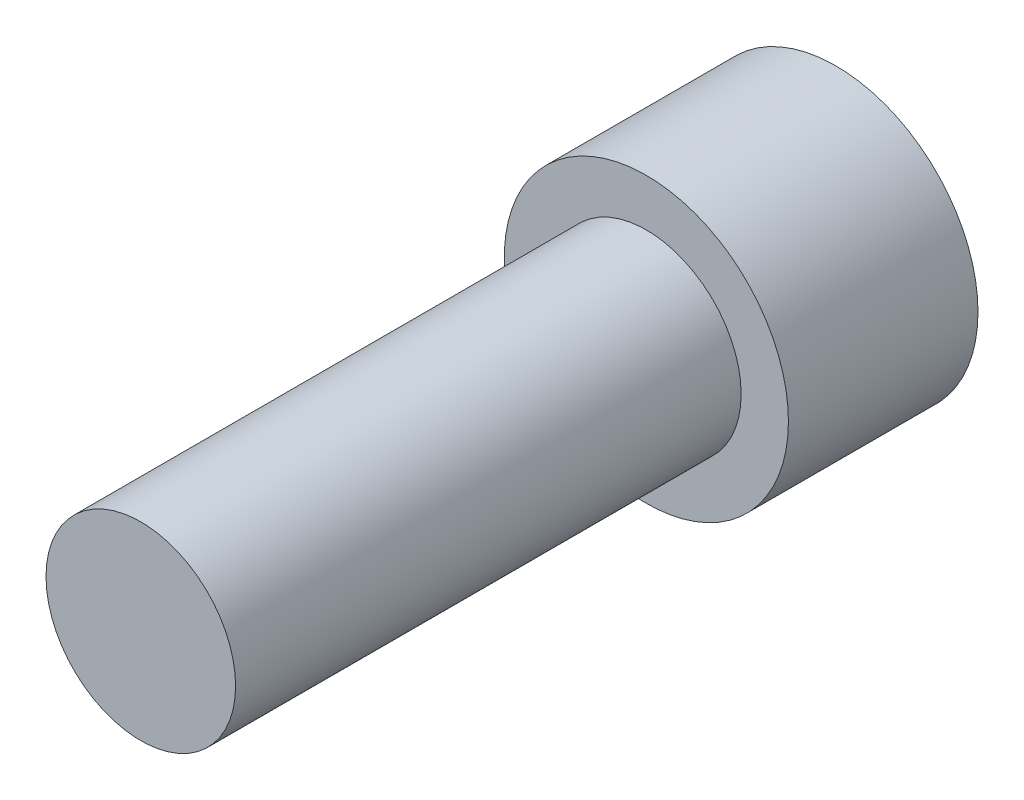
ISO-10303-21;
HEADER;
FILE_DESCRIPTION(('STEP AP214'),'2;1');
FILE_NAME('part.step','',(''),(''),'','','');
FILE_SCHEMA(('AUTOMOTIVE_DESIGN { 1 0 10303 214 1 1 1 1 }'));
ENDSEC;
DATA;
#1=APPLICATION_CONTEXT('core data for automotive mechanical design processes');
#2=APPLICATION_PROTOCOL_DEFINITION('international standard','automotive_design',2000,#1);
#3=PRODUCT_CONTEXT('',#1,'mechanical');
#4=PRODUCT('Part','Part','',(#3));
#5=PRODUCT_RELATED_PRODUCT_CATEGORY('part','',(#4));
#6=PRODUCT_DEFINITION_FORMATION('','',#4);
#7=PRODUCT_DEFINITION_CONTEXT('part definition',#1,'design');
#8=PRODUCT_DEFINITION('design','',#6,#7);
#9=PRODUCT_DEFINITION_SHAPE('','',#8);
#10=(LENGTH_UNIT() NAMED_UNIT(*) SI_UNIT(.MILLI.,.METRE.));
#11=(NAMED_UNIT(*) PLANE_ANGLE_UNIT() SI_UNIT($,.RADIAN.));
#12=(NAMED_UNIT(*) SI_UNIT($,.STERADIAN.) SOLID_ANGLE_UNIT());
#13=UNCERTAINTY_MEASURE_WITH_UNIT(LENGTH_MEASURE(1.E-05),#10,'distance_accuracy_value','');
#14=(GEOMETRIC_REPRESENTATION_CONTEXT(3) GLOBAL_UNCERTAINTY_ASSIGNED_CONTEXT((#13)) GLOBAL_UNIT_ASSIGNED_CONTEXT((#10,
#11,#12)) REPRESENTATION_CONTEXT('',''));
#15=CARTESIAN_POINT('',(0.,0.,0.));
#16=DIRECTION('',(0.,0.,1.));
#17=DIRECTION('',(1.,0.,0.));
#18=AXIS2_PLACEMENT_3D('',#15,#16,#17);
#19=CARTESIAN_POINT('',(0.,0.,25.4));
#20=DIRECTION('',(0.,0.,1.));
#21=DIRECTION('',(1.,0.,0.));
#22=AXIS2_PLACEMENT_3D('',#19,#20,#21);
#23=PLANE('',#22);
#24=CARTESIAN_POINT('',(0.,0.,25.4));
#25=DIRECTION('',(0.,0.,1.));
#26=DIRECTION('',(1.,0.,0.));
#27=AXIS2_PLACEMENT_3D('',#24,#25,#26);
#28=CIRCLE('',#27,4.7625);
#29=CARTESIAN_POINT('',(4.7625,0.,25.4));
#30=VERTEX_POINT('',#29);
#31=EDGE_CURVE('E11',#30,#30,#28,.T.);
#32=ORIENTED_EDGE('',*,*,#31,.T.);
#33=EDGE_LOOP('',(#32));
#34=FACE_BOUND('',#33,.T.);
#35=ADVANCED_FACE('F32',(#34),#23,.T.);
#36=CARTESIAN_POINT('',(0.,0.,25.4));
#37=DIRECTION('',(0.,0.,1.));
#38=DIRECTION('',(1.,0.,0.));
#39=AXIS2_PLACEMENT_3D('',#36,#37,#38);
#40=CYLINDRICAL_SURFACE('',#39,4.7625);
#41=CARTESIAN_POINT('',(0.,0.,0.));
#42=DIRECTION('',(0.,0.,1.));
#43=DIRECTION('',(1.,0.,0.));
#44=AXIS2_PLACEMENT_3D('',#41,#42,#43);
#45=CIRCLE('',#44,4.7625);
#46=CARTESIAN_POINT('',(4.7625,0.,0.));
#47=VERTEX_POINT('',#46);
#48=EDGE_CURVE('E39',#47,#47,#45,.T.);
#49=ORIENTED_EDGE('',*,*,#48,.T.);
#50=EDGE_LOOP('',(#49));
#51=FACE_BOUND('',#50,.T.);
#52=ORIENTED_EDGE('',*,*,#31,.F.);
#53=EDGE_LOOP('',(#52));
#54=FACE_BOUND('',#53,.T.);
#55=ADVANCED_FACE('F146',(#51,#54),#40,.T.);
#56=CARTESIAN_POINT('',(0.,-4.7625,0.));
#57=DIRECTION('',(0.,0.,1.));
#58=DIRECTION('',(1.,0.,0.));
#59=AXIS2_PLACEMENT_3D('',#56,#57,#58);
#60=PLANE('',#59);
#61=CARTESIAN_POINT('',(0.,0.,0.));
#62=DIRECTION('',(0.,0.,1.));
#63=DIRECTION('',(1.,0.,0.));
#64=AXIS2_PLACEMENT_3D('',#61,#62,#63);
#65=CIRCLE('',#64,7.1374);
#66=CARTESIAN_POINT('',(7.1374,0.,0.));
#67=VERTEX_POINT('',#66);
#68=EDGE_CURVE('E141',#67,#67,#65,.T.);
#69=ORIENTED_EDGE('',*,*,#68,.T.);
#70=EDGE_LOOP('',(#69));
#71=FACE_BOUND('',#70,.T.);
#72=ORIENTED_EDGE('',*,*,#48,.F.);
#73=EDGE_LOOP('',(#72));
#74=FACE_BOUND('',#73,.T.);
#75=ADVANCED_FACE('F149',(#71,#74),#60,.T.);
#76=CARTESIAN_POINT('',(0.,0.,25.4));
#77=DIRECTION('',(0.,0.,1.));
#78=DIRECTION('',(1.,0.,0.));
#79=AXIS2_PLACEMENT_3D('',#76,#77,#78);
#80=CYLINDRICAL_SURFACE('',#79,7.1374);
#81=CARTESIAN_POINT('',(0.,0.,-9.525));
#82=DIRECTION('',(0.,0.,1.));
#83=DIRECTION('',(1.,0.,0.));
#84=AXIS2_PLACEMENT_3D('',#81,#82,#83);
#85=CIRCLE('',#84,7.1374);
#86=CARTESIAN_POINT('',(7.1374,0.,-9.525));
#87=VERTEX_POINT('',#86);
#88=EDGE_CURVE('E133',#87,#87,#85,.T.);
#89=ORIENTED_EDGE('',*,*,#88,.T.);
#90=EDGE_LOOP('',(#89));
#91=FACE_BOUND('',#90,.T.);
#92=ORIENTED_EDGE('',*,*,#68,.F.);
#93=EDGE_LOOP('',(#92));
#94=FACE_BOUND('',#93,.T.);
#95=ADVANCED_FACE('F151',(#91,#94),#80,.T.);
#96=CARTESIAN_POINT('',(0.,-7.1374,-9.525));
#97=DIRECTION('',(0.,0.,-1.));
#98=DIRECTION('',(-1.,0.,0.));
#99=AXIS2_PLACEMENT_3D('',#96,#97,#98);
#100=PLANE('',#99);
#101=DIRECTION('',(0.866025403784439,-0.5,0.));
#102=VECTOR('',#101,1.);
#103=CARTESIAN_POINT('',(0.,4.57538541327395,-9.525));
#104=LINE('',#103,#102);
#105=CARTESIAN_POINT('',(0.,4.57538541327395,-9.525));
#106=VERTEX_POINT('',#105);
#107=CARTESIAN_POINT('',(3.9624,2.28769270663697,-9.525));
#108=VERTEX_POINT('',#107);
#109=EDGE_CURVE('E46',#106,#108,#104,.T.);
#110=ORIENTED_EDGE('',*,*,#109,.F.);
#111=DIRECTION('',(0.866025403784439,0.5,0.));
#112=VECTOR('',#111,1.);
#113=CARTESIAN_POINT('',(-3.9624,2.28769270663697,-9.525));
#114=LINE('',#113,#112);
#115=CARTESIAN_POINT('',(-3.9624,2.28769270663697,-9.525));
#116=VERTEX_POINT('',#115);
#117=EDGE_CURVE('E129',#116,#106,#114,.T.);
#118=ORIENTED_EDGE('',*,*,#117,.F.);
#119=DIRECTION('',(0.,1.,0.));
#120=VECTOR('',#119,1.);
#121=CARTESIAN_POINT('',(-3.9624,-2.28769270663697,-9.525));
#122=LINE('',#121,#120);
#123=CARTESIAN_POINT('',(-3.9624,-2.28769270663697,-9.525));
#124=VERTEX_POINT('',#123);
#125=EDGE_CURVE('E127',#124,#116,#122,.T.);
#126=ORIENTED_EDGE('',*,*,#125,.F.);
#127=DIRECTION('',(-0.866025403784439,0.5,0.));
#128=VECTOR('',#127,1.);
#129=CARTESIAN_POINT('',(0.,-4.57538541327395,-9.525));
#130=LINE('',#129,#128);
#131=CARTESIAN_POINT('',(0.,-4.57538541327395,-9.525));
#132=VERTEX_POINT('',#131);
#133=EDGE_CURVE('E94',#132,#124,#130,.T.);
#134=ORIENTED_EDGE('',*,*,#133,.F.);
#135=DIRECTION('',(-0.866025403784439,-0.5,0.));
#136=VECTOR('',#135,1.);
#137=CARTESIAN_POINT('',(3.9624,-2.28769270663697,-9.525));
#138=LINE('',#137,#136);
#139=CARTESIAN_POINT('',(3.9624,-2.28769270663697,-9.525));
#140=VERTEX_POINT('',#139);
#141=EDGE_CURVE('E123',#140,#132,#138,.T.);
#142=ORIENTED_EDGE('',*,*,#141,.F.);
#143=DIRECTION('',(0.,-1.,0.));
#144=VECTOR('',#143,1.);
#145=CARTESIAN_POINT('',(3.9624,2.28769270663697,-9.525));
#146=LINE('',#145,#144);
#147=EDGE_CURVE('E120',#108,#140,#146,.T.);
#148=ORIENTED_EDGE('',*,*,#147,.F.);
#149=EDGE_LOOP('',(#110,#118,#126,#134,#142,#148));
#150=FACE_BOUND('',#149,.T.);
#151=ORIENTED_EDGE('',*,*,#88,.F.);
#152=EDGE_LOOP('',(#151));
#153=FACE_BOUND('',#152,.T.);
#154=ADVANCED_FACE('F158',(#150,#153),#100,.T.);
#155=CARTESIAN_POINT('',(0.,4.57538541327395,-3.683));
#156=DIRECTION('',(0.5,0.866025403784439,0.));
#157=DIRECTION('',(-0.866025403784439,0.5,0.));
#158=AXIS2_PLACEMENT_3D('',#155,#156,#157);
#159=PLANE('',#158);
#160=ORIENTED_EDGE('',*,*,#109,.T.);
#161=DIRECTION('',(0.,0.,-1.));
#162=VECTOR('',#161,1.);
#163=CARTESIAN_POINT('',(3.9624,2.28769270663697,-3.683));
#164=LINE('',#163,#162);
#165=CARTESIAN_POINT('',(3.9624,2.28769270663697,-3.683));
#166=VERTEX_POINT('',#165);
#167=EDGE_CURVE('E76',#166,#108,#164,.T.);
#168=ORIENTED_EDGE('',*,*,#167,.F.);
#169=DIRECTION('',(0.866025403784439,-0.5,0.));
#170=VECTOR('',#169,1.);
#171=CARTESIAN_POINT('',(0.,4.57538541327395,-3.683));
#172=LINE('',#171,#170);
#173=CARTESIAN_POINT('',(0.,4.57538541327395,-3.683));
#174=VERTEX_POINT('',#173);
#175=EDGE_CURVE('E131',#174,#166,#172,.T.);
#176=ORIENTED_EDGE('',*,*,#175,.F.);
#177=DIRECTION('',(0.,0.,-1.));
#178=VECTOR('',#177,1.);
#179=CARTESIAN_POINT('',(0.,4.57538541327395,-3.683));
#180=LINE('',#179,#178);
#181=EDGE_CURVE('E54',#174,#106,#180,.T.);
#182=ORIENTED_EDGE('',*,*,#181,.T.);
#183=EDGE_LOOP('',(#160,#168,#176,#182));
#184=FACE_BOUND('',#183,.T.);
#185=ADVANCED_FACE('F189',(#184),#159,.F.);
#186=CARTESIAN_POINT('',(-3.9624,2.28769270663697,-3.683));
#187=DIRECTION('',(-0.5,0.866025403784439,0.));
#188=DIRECTION('',(-0.866025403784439,-0.5,0.));
#189=AXIS2_PLACEMENT_3D('',#186,#187,#188);
#190=PLANE('',#189);
#191=ORIENTED_EDGE('',*,*,#117,.T.);
#192=ORIENTED_EDGE('',*,*,#181,.F.);
#193=DIRECTION('',(0.866025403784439,0.5,0.));
#194=VECTOR('',#193,1.);
#195=CARTESIAN_POINT('',(-3.9624,2.28769270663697,-3.683));
#196=LINE('',#195,#194);
#197=CARTESIAN_POINT('',(-3.9624,2.28769270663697,-3.683));
#198=VERTEX_POINT('',#197);
#199=EDGE_CURVE('E106',#198,#174,#196,.T.);
#200=ORIENTED_EDGE('',*,*,#199,.F.);
#201=DIRECTION('',(0.,0.,-1.));
#202=VECTOR('',#201,1.);
#203=CARTESIAN_POINT('',(-3.9624,2.28769270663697,-3.683));
#204=LINE('',#203,#202);
#205=EDGE_CURVE('E98',#198,#116,#204,.T.);
#206=ORIENTED_EDGE('',*,*,#205,.T.);
#207=EDGE_LOOP('',(#191,#192,#200,#206));
#208=FACE_BOUND('',#207,.T.);
#209=ADVANCED_FACE('F199',(#208),#190,.F.);
#210=CARTESIAN_POINT('',(-3.9624,-2.28769270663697,-3.683));
#211=DIRECTION('',(-1.,0.,0.));
#212=DIRECTION('',(0.,0.,1.));
#213=AXIS2_PLACEMENT_3D('',#210,#211,#212);
#214=PLANE('',#213);
#215=ORIENTED_EDGE('',*,*,#125,.T.);
#216=ORIENTED_EDGE('',*,*,#205,.F.);
#217=DIRECTION('',(0.,1.,0.));
#218=VECTOR('',#217,1.);
#219=CARTESIAN_POINT('',(-3.9624,-2.28769270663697,-3.683));
#220=LINE('',#219,#218);
#221=CARTESIAN_POINT('',(-3.9624,-2.28769270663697,-3.683));
#222=VERTEX_POINT('',#221);
#223=EDGE_CURVE('E102',#222,#198,#220,.T.);
#224=ORIENTED_EDGE('',*,*,#223,.F.);
#225=DIRECTION('',(0.,0.,-1.));
#226=VECTOR('',#225,1.);
#227=CARTESIAN_POINT('',(-3.9624,-2.28769270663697,-3.683));
#228=LINE('',#227,#226);
#229=EDGE_CURVE('E87',#222,#124,#228,.T.);
#230=ORIENTED_EDGE('',*,*,#229,.T.);
#231=EDGE_LOOP('',(#215,#216,#224,#230));
#232=FACE_BOUND('',#231,.T.);
#233=ADVANCED_FACE('F103',(#232),#214,.F.);
#234=CARTESIAN_POINT('',(0.,-4.57538541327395,-3.683));
#235=DIRECTION('',(-0.5,-0.866025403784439,0.));
#236=DIRECTION('',(0.866025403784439,-0.5,0.));
#237=AXIS2_PLACEMENT_3D('',#234,#235,#236);
#238=PLANE('',#237);
#239=ORIENTED_EDGE('',*,*,#133,.T.);
#240=ORIENTED_EDGE('',*,*,#229,.F.);
#241=DIRECTION('',(-0.866025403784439,0.5,0.));
#242=VECTOR('',#241,1.);
#243=CARTESIAN_POINT('',(0.,-4.57538541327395,-3.683));
#244=LINE('',#243,#242);
#245=CARTESIAN_POINT('',(0.,-4.57538541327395,-3.683));
#246=VERTEX_POINT('',#245);
#247=EDGE_CURVE('E91',#246,#222,#244,.T.);
#248=ORIENTED_EDGE('',*,*,#247,.F.);
#249=DIRECTION('',(0.,0.,-1.));
#250=VECTOR('',#249,1.);
#251=CARTESIAN_POINT('',(0.,-4.57538541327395,-3.683));
#252=LINE('',#251,#250);
#253=EDGE_CURVE('E99',#246,#132,#252,.T.);
#254=ORIENTED_EDGE('',*,*,#253,.T.);
#255=EDGE_LOOP('',(#239,#240,#248,#254));
#256=FACE_BOUND('',#255,.T.);
#257=ADVANCED_FACE('F89',(#256),#238,.F.);
#258=CARTESIAN_POINT('',(3.9624,-2.28769270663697,-3.683));
#259=DIRECTION('',(0.5,-0.866025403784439,0.));
#260=DIRECTION('',(0.866025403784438,0.5,0.));
#261=AXIS2_PLACEMENT_3D('',#258,#259,#260);
#262=PLANE('',#261);
#263=ORIENTED_EDGE('',*,*,#141,.T.);
#264=ORIENTED_EDGE('',*,*,#253,.F.);
#265=DIRECTION('',(-0.866025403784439,-0.5,0.));
#266=VECTOR('',#265,1.);
#267=CARTESIAN_POINT('',(3.9624,-2.28769270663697,-3.683));
#268=LINE('',#267,#266);
#269=CARTESIAN_POINT('',(3.9624,-2.28769270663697,-3.683));
#270=VERTEX_POINT('',#269);
#271=EDGE_CURVE('E112',#270,#246,#268,.T.);
#272=ORIENTED_EDGE('',*,*,#271,.F.);
#273=DIRECTION('',(0.,0.,-1.));
#274=VECTOR('',#273,1.);
#275=CARTESIAN_POINT('',(3.9624,-2.28769270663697,-3.683));
#276=LINE('',#275,#274);
#277=EDGE_CURVE('E136',#270,#140,#276,.T.);
#278=ORIENTED_EDGE('',*,*,#277,.T.);
#279=EDGE_LOOP('',(#263,#264,#272,#278));
#280=FACE_BOUND('',#279,.T.);
#281=ADVANCED_FACE('F224',(#280),#262,.F.);
#282=CARTESIAN_POINT('',(3.9624,2.28769270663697,-3.683));
#283=DIRECTION('',(1.,0.,0.));
#284=DIRECTION('',(0.,0.,-1.));
#285=AXIS2_PLACEMENT_3D('',#282,#283,#284);
#286=PLANE('',#285);
#287=ORIENTED_EDGE('',*,*,#147,.T.);
#288=ORIENTED_EDGE('',*,*,#277,.F.);
#289=DIRECTION('',(0.,-1.,0.));
#290=VECTOR('',#289,1.);
#291=CARTESIAN_POINT('',(3.9624,2.28769270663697,-3.683));
#292=LINE('',#291,#290);
#293=EDGE_CURVE('E114',#166,#270,#292,.T.);
#294=ORIENTED_EDGE('',*,*,#293,.F.);
#295=ORIENTED_EDGE('',*,*,#167,.T.);
#296=EDGE_LOOP('',(#287,#288,#294,#295));
#297=FACE_BOUND('',#296,.T.);
#298=ADVANCED_FACE('F233',(#297),#286,.F.);
#299=CARTESIAN_POINT('',(7.9248,0.,-3.683));
#300=DIRECTION('',(0.,0.,-1.));
#301=DIRECTION('',(-1.,0.,0.));
#302=AXIS2_PLACEMENT_3D('',#299,#300,#301);
#303=PLANE('',#302);
#304=ORIENTED_EDGE('',*,*,#175,.T.);
#305=ORIENTED_EDGE('',*,*,#293,.T.);
#306=ORIENTED_EDGE('',*,*,#271,.T.);
#307=ORIENTED_EDGE('',*,*,#247,.T.);
#308=ORIENTED_EDGE('',*,*,#223,.T.);
#309=ORIENTED_EDGE('',*,*,#199,.T.);
#310=EDGE_LOOP('',(#304,#305,#306,#307,#308,#309));
#311=FACE_BOUND('',#310,.T.);
#312=ADVANCED_FACE('F109',(#311),#303,.T.);
#313=CLOSED_SHELL('',(#35,#55,#75,#95,#154,#185,#209,#233,#257,#281,#298,#312));
#314=MANIFOLD_SOLID_BREP('B2',#313);
#315=ADVANCED_BREP_SHAPE_REPRESENTATION('',(#18,#314),#14);
#316=SHAPE_DEFINITION_REPRESENTATION(#9,#315);
ENDSEC;
END-ISO-10303-21;
